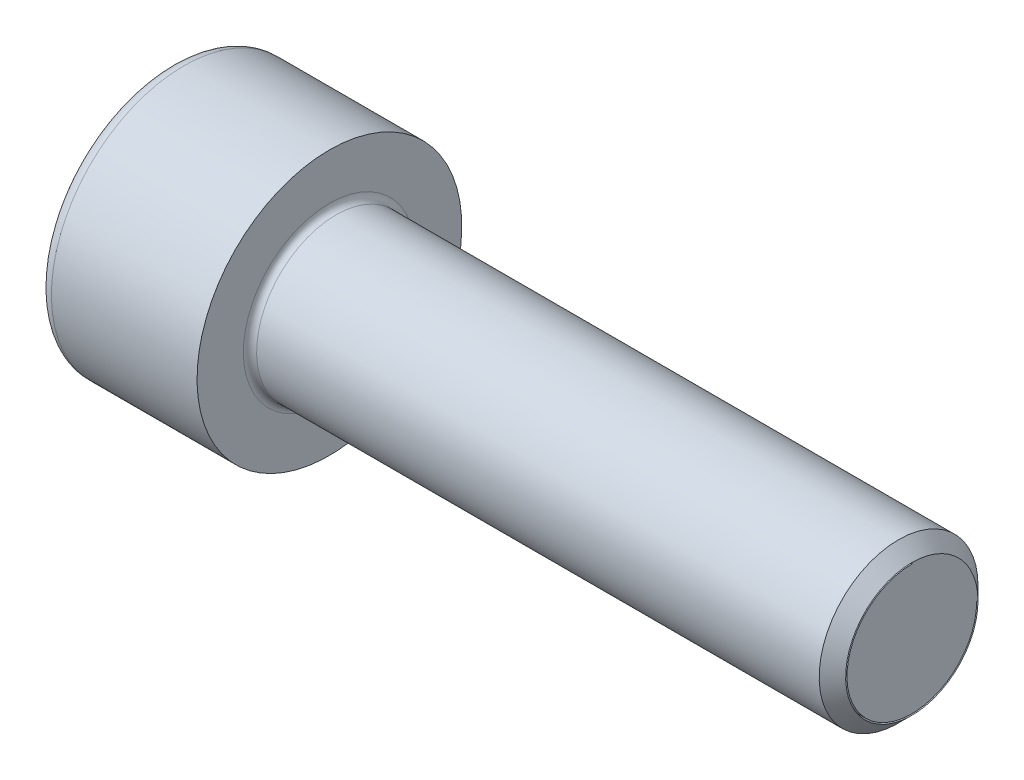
ISO-10303-21;
HEADER;
FILE_DESCRIPTION(('STEP AP214'),'2;1');
FILE_NAME('part.step','',(''),(''),'','','');
FILE_SCHEMA(('AUTOMOTIVE_DESIGN { 1 0 10303 214 1 1 1 1 }'));
ENDSEC;
DATA;
#1=APPLICATION_CONTEXT('core data for automotive mechanical design processes');
#2=APPLICATION_PROTOCOL_DEFINITION('international standard','automotive_design',2000,#1);
#3=PRODUCT_CONTEXT('',#1,'mechanical');
#4=PRODUCT('Part','Part','',(#3));
#5=PRODUCT_RELATED_PRODUCT_CATEGORY('part','',(#4));
#6=PRODUCT_DEFINITION_FORMATION('','',#4);
#7=PRODUCT_DEFINITION_CONTEXT('part definition',#1,'design');
#8=PRODUCT_DEFINITION('design','',#6,#7);
#9=PRODUCT_DEFINITION_SHAPE('','',#8);
#10=(LENGTH_UNIT() NAMED_UNIT(*) SI_UNIT(.MILLI.,.METRE.));
#11=(NAMED_UNIT(*) PLANE_ANGLE_UNIT() SI_UNIT($,.RADIAN.));
#12=(NAMED_UNIT(*) SI_UNIT($,.STERADIAN.) SOLID_ANGLE_UNIT());
#13=UNCERTAINTY_MEASURE_WITH_UNIT(LENGTH_MEASURE(1.E-05),#10,'distance_accuracy_value','');
#14=(GEOMETRIC_REPRESENTATION_CONTEXT(3) GLOBAL_UNCERTAINTY_ASSIGNED_CONTEXT((#13)) GLOBAL_UNIT_ASSIGNED_CONTEXT((#10,
#11,#12)) REPRESENTATION_CONTEXT('',''));
#15=CARTESIAN_POINT('',(0.,0.,0.));
#16=DIRECTION('',(0.,0.,1.));
#17=DIRECTION('',(1.,0.,0.));
#18=AXIS2_PLACEMENT_3D('',#15,#16,#17);
#19=CARTESIAN_POINT('',(-36.2000000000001,29.5000000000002,81.0000000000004));
#20=DIRECTION('',(1.,0.,0.));
#21=DIRECTION('',(0.,0.,-1.));
#22=AXIS2_PLACEMENT_3D('',#19,#20,#21);
#23=PLANE('',#22);
#24=CARTESIAN_POINT('',(-36.2000000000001,28.0000000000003,81.0000000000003));
#25=DIRECTION('',(-1.,0.,0.));
#26=DIRECTION('',(0.,1.,0.));
#27=AXIS2_PLACEMENT_3D('',#24,#25,#26);
#28=CIRCLE('',#27,2.45);
#29=CARTESIAN_POINT('',(-36.2000000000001,28.0000000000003,78.5500000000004));
#30=VERTEX_POINT('',#29);
#31=CARTESIAN_POINT('',(-36.2000000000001,30.4500000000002,81.0000000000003));
#32=VERTEX_POINT('',#31);
#33=EDGE_CURVE('E58',#30,#32,#28,.T.);
#34=ORIENTED_EDGE('',*,*,#33,.T.);
#35=DIRECTION('',(0.,1.,0.));
#36=VECTOR('',#35,1.);
#37=CARTESIAN_POINT('',(-36.2000000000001,29.9875000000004,81.0000000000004));
#38=LINE('',#37,#36);
#39=CARTESIAN_POINT('',(-36.2000000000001,30.5000000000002,81.0000000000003));
#40=VERTEX_POINT('',#39);
#41=EDGE_CURVE('E280',#32,#40,#38,.T.);
#42=ORIENTED_EDGE('',*,*,#41,.T.);
#43=CARTESIAN_POINT('',(-36.2000000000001,28.0000000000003,81.0000000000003));
#44=DIRECTION('',(1.,0.,0.));
#45=DIRECTION('',(0.,1.,0.));
#46=AXIS2_PLACEMENT_3D('',#43,#44,#45);
#47=CIRCLE('',#46,2.5);
#48=CARTESIAN_POINT('',(-36.2000000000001,28.0000000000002,78.5000000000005));
#49=VERTEX_POINT('',#48);
#50=EDGE_CURVE('E251',#40,#49,#47,.T.);
#51=ORIENTED_EDGE('',*,*,#50,.T.);
#52=DIRECTION('',(0.,0.,1.));
#53=VECTOR('',#52,1.);
#54=CARTESIAN_POINT('',(-36.2000000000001,28.0000000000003,79.7625000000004));
#55=LINE('',#54,#53);
#56=EDGE_CURVE('E281',#49,#30,#55,.T.);
#57=ORIENTED_EDGE('',*,*,#56,.T.);
#58=EDGE_LOOP('',(#34,#42,#51,#57));
#59=FACE_BOUND('',#58,.T.);
#60=ADVANCED_FACE('F40',(#59),#23,.T.);
#61=CARTESIAN_POINT('',(-37.5750000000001,28.0000000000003,81.0000000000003));
#62=DIRECTION('',(-1.,0.,0.));
#63=DIRECTION('',(0.,0.,1.));
#64=AXIS2_PLACEMENT_3D('',#61,#62,#63);
#65=CYLINDRICAL_SURFACE('',#64,3.);
#66=CARTESIAN_POINT('',(-17.7,28.0000000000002,81.0000000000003));
#67=DIRECTION('',(1.,0.,0.));
#68=DIRECTION('',(0.,0.,-1.));
#69=AXIS2_PLACEMENT_3D('',#66,#67,#68);
#70=CIRCLE('',#69,3.);
#71=CARTESIAN_POINT('',(-17.7,28.0000000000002,78.0000000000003));
#72=VERTEX_POINT('',#71);
#73=EDGE_CURVE('E11',#72,#72,#70,.F.);
#74=ORIENTED_EDGE('',*,*,#73,.T.);
#75=EDGE_LOOP('',(#74));
#76=FACE_BOUND('',#75,.T.);
#77=CARTESIAN_POINT('',(-38.9500000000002,28.0000000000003,81.0000000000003));
#78=DIRECTION('',(1.,0.,0.));
#79=DIRECTION('',(0.,1.,0.));
#80=AXIS2_PLACEMENT_3D('',#77,#78,#79);
#81=CIRCLE('',#80,3.);
#82=CARTESIAN_POINT('',(-38.9500000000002,31.0000000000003,81.0000000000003));
#83=VERTEX_POINT('',#82);
#84=EDGE_CURVE('E275',#83,#83,#81,.T.);
#85=ORIENTED_EDGE('',*,*,#84,.T.);
#86=EDGE_LOOP('',(#85));
#87=FACE_BOUND('',#86,.T.);
#88=ADVANCED_FACE('F162',(#76,#87),#65,.T.);
#89=CARTESIAN_POINT('',(-38.9500000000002,28.0000000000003,81.0000000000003));
#90=DIRECTION('',(1.,0.,0.));
#91=DIRECTION('',(0.,0.,-1.));
#92=AXIS2_PLACEMENT_3D('',#89,#90,#91);
#93=TOROIDAL_SURFACE('',#92,3.24999999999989,0.25);
#94=CARTESIAN_POINT('',(-39.2000000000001,28.0000000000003,81.0000000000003));
#95=DIRECTION('',(1.,0.,0.));
#96=DIRECTION('',(0.,1.,0.));
#97=AXIS2_PLACEMENT_3D('',#94,#95,#96);
#98=CIRCLE('',#97,3.25);
#99=CARTESIAN_POINT('',(-39.2000000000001,31.2500000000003,81.0000000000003));
#100=VERTEX_POINT('',#99);
#101=EDGE_CURVE('E271',#100,#100,#98,.T.);
#102=ORIENTED_EDGE('',*,*,#101,.T.);
#103=EDGE_LOOP('',(#102));
#104=FACE_BOUND('',#103,.T.);
#105=ORIENTED_EDGE('',*,*,#84,.F.);
#106=EDGE_LOOP('',(#105));
#107=FACE_BOUND('',#106,.T.);
#108=ADVANCED_FACE('F157',(#104,#107),#93,.F.);
#109=CARTESIAN_POINT('',(-39.2000000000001,32.1250000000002,81.0000000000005));
#110=DIRECTION('',(1.,0.,0.));
#111=DIRECTION('',(0.,0.,-1.));
#112=AXIS2_PLACEMENT_3D('',#109,#110,#111);
#113=PLANE('',#112);
#114=CARTESIAN_POINT('',(-39.2000000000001,28.0000000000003,81.0000000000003));
#115=DIRECTION('',(1.,0.,0.));
#116=DIRECTION('',(0.,1.,0.));
#117=AXIS2_PLACEMENT_3D('',#114,#115,#116);
#118=CIRCLE('',#117,5.);
#119=CARTESIAN_POINT('',(-39.2000000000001,33.0000000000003,81.0000000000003));
#120=VERTEX_POINT('',#119);
#121=EDGE_CURVE('E291',#120,#120,#118,.T.);
#122=ORIENTED_EDGE('',*,*,#121,.T.);
#123=EDGE_LOOP('',(#122));
#124=FACE_BOUND('',#123,.T.);
#125=ORIENTED_EDGE('',*,*,#101,.F.);
#126=EDGE_LOOP('',(#125));
#127=FACE_BOUND('',#126,.T.);
#128=ADVANCED_FACE('F161',(#124,#127),#113,.T.);
#129=CARTESIAN_POINT('',(-41.9500000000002,28.0000000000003,81.0000000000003));
#130=DIRECTION('',(-1.,0.,0.));
#131=DIRECTION('',(0.,0.,1.));
#132=AXIS2_PLACEMENT_3D('',#129,#130,#131);
#133=CYLINDRICAL_SURFACE('',#132,5.);
#134=CARTESIAN_POINT('',(-44.7000000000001,28.0000000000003,81.0000000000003));
#135=DIRECTION('',(1.,0.,0.));
#136=DIRECTION('',(0.,1.,0.));
#137=AXIS2_PLACEMENT_3D('',#134,#135,#136);
#138=CIRCLE('',#137,5.);
#139=CARTESIAN_POINT('',(-44.7000000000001,33.0000000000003,81.0000000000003));
#140=VERTEX_POINT('',#139);
#141=EDGE_CURVE('E255',#140,#140,#138,.T.);
#142=ORIENTED_EDGE('',*,*,#141,.T.);
#143=EDGE_LOOP('',(#142));
#144=FACE_BOUND('',#143,.T.);
#145=ORIENTED_EDGE('',*,*,#121,.F.);
#146=EDGE_LOOP('',(#145));
#147=FACE_BOUND('',#146,.T.);
#148=ADVANCED_FACE('F167',(#144,#147),#133,.T.);
#149=CARTESIAN_POINT('',(-44.7000000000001,28.0000000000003,81.0000000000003));
#150=DIRECTION('',(1.,0.,0.));
#151=DIRECTION('',(0.,0.,-1.));
#152=AXIS2_PLACEMENT_3D('',#149,#150,#151);
#153=TOROIDAL_SURFACE('',#152,4.49999999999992,0.5);
#154=CARTESIAN_POINT('',(-45.2000000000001,28.0000000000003,81.0000000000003));
#155=DIRECTION('',(1.,0.,0.));
#156=DIRECTION('',(0.,1.,0.));
#157=AXIS2_PLACEMENT_3D('',#154,#155,#156);
#158=CIRCLE('',#157,4.5);
#159=CARTESIAN_POINT('',(-45.2000000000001,32.5000000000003,81.0000000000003));
#160=VERTEX_POINT('',#159);
#161=EDGE_CURVE('E147',#160,#160,#158,.T.);
#162=ORIENTED_EDGE('',*,*,#161,.T.);
#163=EDGE_LOOP('',(#162));
#164=FACE_BOUND('',#163,.T.);
#165=ORIENTED_EDGE('',*,*,#141,.F.);
#166=EDGE_LOOP('',(#165));
#167=FACE_BOUND('',#166,.T.);
#168=ADVANCED_FACE('F171',(#164,#167),#153,.T.);
#169=CARTESIAN_POINT('',(-45.2000000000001,30.2500000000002,81.0000000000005));
#170=DIRECTION('',(-1.,0.,0.));
#171=DIRECTION('',(0.,0.,1.));
#172=AXIS2_PLACEMENT_3D('',#169,#170,#171);
#173=PLANE('',#172);
#174=ORIENTED_EDGE('',*,*,#161,.F.);
#175=EDGE_LOOP('',(#174));
#176=FACE_BOUND('',#175,.T.);
#177=DIRECTION('',(0.,-0.500000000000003,-0.866025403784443));
#178=VECTOR('',#177,1.);
#179=CARTESIAN_POINT('',(-45.2,26.4770304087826,83.3621392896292));
#180=LINE('',#179,#178);
#181=CARTESIAN_POINT('',(-45.2,26.5566243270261,83.5000000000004));
#182=VERTEX_POINT('',#181);
#183=CARTESIAN_POINT('',(-45.2,25.1132486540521,81.0000000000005));
#184=VERTEX_POINT('',#183);
#185=EDGE_CURVE('E141',#182,#184,#180,.T.);
#186=ORIENTED_EDGE('',*,*,#185,.T.);
#187=DIRECTION('',(0.,0.5,-0.866025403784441));
#188=VECTOR('',#187,1.);
#189=CARTESIAN_POINT('',(-45.2,25.7553425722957,79.8878607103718));
#190=LINE('',#189,#188);
#191=CARTESIAN_POINT('',(-45.2,26.5566243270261,78.5000000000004));
#192=VERTEX_POINT('',#191);
#193=EDGE_CURVE('E123',#184,#192,#190,.T.);
#194=ORIENTED_EDGE('',*,*,#193,.T.);
#195=DIRECTION('',(0.,1.,0.));
#196=VECTOR('',#195,1.);
#197=CARTESIAN_POINT('',(-45.2000000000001,28.4033121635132,78.5000000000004));
#198=LINE('',#197,#196);
#199=CARTESIAN_POINT('',(-45.2000000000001,29.4433756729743,78.5000000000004));
#200=VERTEX_POINT('',#199);
#201=EDGE_CURVE('E133',#192,#200,#198,.T.);
#202=ORIENTED_EDGE('',*,*,#201,.T.);
#203=DIRECTION('',(0.,0.500000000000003,0.866025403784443));
#204=VECTOR('',#203,1.);
#205=CARTESIAN_POINT('',(-45.2000000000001,30.0854695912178,79.612139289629));
#206=LINE('',#205,#204);
#207=CARTESIAN_POINT('',(-45.2000000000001,30.8867513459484,81.0000000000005));
#208=VERTEX_POINT('',#207);
#209=EDGE_CURVE('E112',#200,#208,#206,.T.);
#210=ORIENTED_EDGE('',*,*,#209,.T.);
#211=DIRECTION('',(0.,-0.5,0.866025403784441));
#212=VECTOR('',#211,1.);
#213=CARTESIAN_POINT('',(-45.2000000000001,30.8071574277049,81.1378607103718));
#214=LINE('',#213,#212);
#215=CARTESIAN_POINT('',(-45.2000000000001,29.4433756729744,83.5000000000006));
#216=VERTEX_POINT('',#215);
#217=EDGE_CURVE('E287',#208,#216,#214,.T.);
#218=ORIENTED_EDGE('',*,*,#217,.T.);
#219=DIRECTION('',(0.,-1.,0.));
#220=VECTOR('',#219,1.);
#221=CARTESIAN_POINT('',(-45.2000000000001,29.8466878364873,83.5000000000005));
#222=LINE('',#221,#220);
#223=EDGE_CURVE('E284',#216,#182,#222,.T.);
#224=ORIENTED_EDGE('',*,*,#223,.T.);
#225=EDGE_LOOP('',(#186,#194,#202,#210,#218,#224));
#226=FACE_BOUND('',#225,.T.);
#227=ADVANCED_FACE('F139',(#176,#226),#173,.T.);
#228=CARTESIAN_POINT('',(-42.2000000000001,28.0000000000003,81.0000000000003));
#229=DIRECTION('',(-1.,0.,0.));
#230=DIRECTION('',(0.,-1.,0.));
#231=AXIS2_PLACEMENT_3D('',#228,#229,#230);
#232=PLANE('',#231);
#233=DIRECTION('',(0.,1.,0.));
#234=VECTOR('',#233,1.);
#235=CARTESIAN_POINT('',(-42.2,26.5566243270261,83.5000000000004));
#236=LINE('',#235,#234);
#237=CARTESIAN_POINT('',(-42.2,26.5566243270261,83.5000000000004));
#238=VERTEX_POINT('',#237);
#239=CARTESIAN_POINT('',(-42.2000000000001,29.4433756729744,83.5000000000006));
#240=VERTEX_POINT('',#239);
#241=EDGE_CURVE('E288',#238,#240,#236,.T.);
#242=ORIENTED_EDGE('',*,*,#241,.T.);
#243=DIRECTION('',(0.,0.5,-0.866025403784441));
#244=VECTOR('',#243,1.);
#245=CARTESIAN_POINT('',(-42.2000000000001,29.4433756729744,83.5000000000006));
#246=LINE('',#245,#244);
#247=CARTESIAN_POINT('',(-42.2000000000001,30.8867513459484,81.0000000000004));
#248=VERTEX_POINT('',#247);
#249=EDGE_CURVE('E317',#240,#248,#246,.T.);
#250=ORIENTED_EDGE('',*,*,#249,.T.);
#251=DIRECTION('',(0.,-0.500000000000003,-0.866025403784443));
#252=VECTOR('',#251,1.);
#253=CARTESIAN_POINT('',(-42.2000000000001,30.8867513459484,81.0000000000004));
#254=LINE('',#253,#252);
#255=CARTESIAN_POINT('',(-42.2000000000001,29.4433756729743,78.5000000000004));
#256=VERTEX_POINT('',#255);
#257=EDGE_CURVE('E297',#248,#256,#254,.T.);
#258=ORIENTED_EDGE('',*,*,#257,.T.);
#259=DIRECTION('',(0.,-1.,0.));
#260=VECTOR('',#259,1.);
#261=CARTESIAN_POINT('',(-42.2000000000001,29.4433756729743,78.5000000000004));
#262=LINE('',#261,#260);
#263=CARTESIAN_POINT('',(-42.2,26.5566243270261,78.5000000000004));
#264=VERTEX_POINT('',#263);
#265=EDGE_CURVE('E295',#256,#264,#262,.T.);
#266=ORIENTED_EDGE('',*,*,#265,.T.);
#267=DIRECTION('',(0.,-0.5,0.866025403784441));
#268=VECTOR('',#267,1.);
#269=CARTESIAN_POINT('',(-42.2,26.5566243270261,78.5000000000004));
#270=LINE('',#269,#268);
#271=CARTESIAN_POINT('',(-42.2,25.1132486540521,81.0000000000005));
#272=VERTEX_POINT('',#271);
#273=EDGE_CURVE('E125',#264,#272,#270,.T.);
#274=ORIENTED_EDGE('',*,*,#273,.T.);
#275=DIRECTION('',(0.,0.500000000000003,0.866025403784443));
#276=VECTOR('',#275,1.);
#277=CARTESIAN_POINT('',(-42.2,25.1132486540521,81.0000000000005));
#278=LINE('',#277,#276);
#279=EDGE_CURVE('E302',#272,#238,#278,.T.);
#280=ORIENTED_EDGE('',*,*,#279,.T.);
#281=EDGE_LOOP('',(#242,#250,#258,#266,#274,#280));
#282=FACE_BOUND('',#281,.T.);
#283=ADVANCED_FACE('F178',(#282),#232,.T.);
#284=CARTESIAN_POINT('',(-42.2,26.5566243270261,78.5000000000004));
#285=DIRECTION('',(0.,0.,1.));
#286=DIRECTION('',(1.,0.,0.));
#287=AXIS2_PLACEMENT_3D('',#284,#285,#286);
#288=PLANE('',#287);
#289=ORIENTED_EDGE('',*,*,#201,.F.);
#290=DIRECTION('',(-1.,0.,0.));
#291=VECTOR('',#290,1.);
#292=CARTESIAN_POINT('',(-42.2,26.5566243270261,78.5000000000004));
#293=LINE('',#292,#291);
#294=EDGE_CURVE('E119',#264,#192,#293,.T.);
#295=ORIENTED_EDGE('',*,*,#294,.F.);
#296=ORIENTED_EDGE('',*,*,#265,.F.);
#297=DIRECTION('',(-1.,0.,0.));
#298=VECTOR('',#297,1.);
#299=CARTESIAN_POINT('',(-42.2000000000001,29.4433756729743,78.5000000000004));
#300=LINE('',#299,#298);
#301=EDGE_CURVE('E129',#256,#200,#300,.T.);
#302=ORIENTED_EDGE('',*,*,#301,.T.);
#303=EDGE_LOOP('',(#289,#295,#296,#302));
#304=FACE_BOUND('',#303,.T.);
#305=ADVANCED_FACE('F134',(#304),#288,.T.);
#306=CARTESIAN_POINT('',(-42.2,25.1132486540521,81.0000000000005));
#307=DIRECTION('',(0.,0.866025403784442,0.500000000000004));
#308=DIRECTION('',(0.,-0.5,0.866025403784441));
#309=AXIS2_PLACEMENT_3D('',#306,#307,#308);
#310=PLANE('',#309);
#311=ORIENTED_EDGE('',*,*,#193,.F.);
#312=DIRECTION('',(-1.,0.,0.));
#313=VECTOR('',#312,1.);
#314=CARTESIAN_POINT('',(-42.2,25.1132486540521,81.0000000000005));
#315=LINE('',#314,#313);
#316=EDGE_CURVE('E130',#272,#184,#315,.T.);
#317=ORIENTED_EDGE('',*,*,#316,.F.);
#318=ORIENTED_EDGE('',*,*,#273,.F.);
#319=ORIENTED_EDGE('',*,*,#294,.T.);
#320=EDGE_LOOP('',(#311,#317,#318,#319));
#321=FACE_BOUND('',#320,.T.);
#322=ADVANCED_FACE('F121',(#321),#310,.T.);
#323=CARTESIAN_POINT('',(-42.2,26.5566243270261,83.5000000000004));
#324=DIRECTION('',(0.,0.86602540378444,-0.5));
#325=DIRECTION('',(0.,0.500000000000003,0.866025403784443));
#326=AXIS2_PLACEMENT_3D('',#323,#324,#325);
#327=PLANE('',#326);
#328=ORIENTED_EDGE('',*,*,#185,.F.);
#329=DIRECTION('',(-1.,0.,0.));
#330=VECTOR('',#329,1.);
#331=CARTESIAN_POINT('',(-42.2,26.5566243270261,83.5000000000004));
#332=LINE('',#331,#330);
#333=EDGE_CURVE('E313',#238,#182,#332,.T.);
#334=ORIENTED_EDGE('',*,*,#333,.F.);
#335=ORIENTED_EDGE('',*,*,#279,.F.);
#336=ORIENTED_EDGE('',*,*,#316,.T.);
#337=EDGE_LOOP('',(#328,#334,#335,#336));
#338=FACE_BOUND('',#337,.T.);
#339=ADVANCED_FACE('F187',(#338),#327,.T.);
#340=CARTESIAN_POINT('',(-42.2000000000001,29.4433756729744,83.5000000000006));
#341=DIRECTION('',(0.,0.,-1.));
#342=DIRECTION('',(-1.,0.,0.));
#343=AXIS2_PLACEMENT_3D('',#340,#341,#342);
#344=PLANE('',#343);
#345=ORIENTED_EDGE('',*,*,#223,.F.);
#346=DIRECTION('',(-1.,0.,0.));
#347=VECTOR('',#346,1.);
#348=CARTESIAN_POINT('',(-42.2000000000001,29.4433756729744,83.5000000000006));
#349=LINE('',#348,#347);
#350=EDGE_CURVE('E326',#240,#216,#349,.T.);
#351=ORIENTED_EDGE('',*,*,#350,.F.);
#352=ORIENTED_EDGE('',*,*,#241,.F.);
#353=ORIENTED_EDGE('',*,*,#333,.T.);
#354=EDGE_LOOP('',(#345,#351,#352,#353));
#355=FACE_BOUND('',#354,.T.);
#356=ADVANCED_FACE('F190',(#355),#344,.T.);
#357=CARTESIAN_POINT('',(-42.2000000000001,30.8867513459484,81.0000000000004));
#358=DIRECTION('',(0.,-0.866025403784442,-0.500000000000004));
#359=DIRECTION('',(0.,0.5,-0.866025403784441));
#360=AXIS2_PLACEMENT_3D('',#357,#358,#359);
#361=PLANE('',#360);
#362=ORIENTED_EDGE('',*,*,#217,.F.);
#363=DIRECTION('',(-1.,0.,0.));
#364=VECTOR('',#363,1.);
#365=CARTESIAN_POINT('',(-42.2000000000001,30.8867513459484,81.0000000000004));
#366=LINE('',#365,#364);
#367=EDGE_CURVE('E151',#248,#208,#366,.T.);
#368=ORIENTED_EDGE('',*,*,#367,.F.);
#369=ORIENTED_EDGE('',*,*,#249,.F.);
#370=ORIENTED_EDGE('',*,*,#350,.T.);
#371=EDGE_LOOP('',(#362,#368,#369,#370));
#372=FACE_BOUND('',#371,.T.);
#373=ADVANCED_FACE('F194',(#372),#361,.T.);
#374=CARTESIAN_POINT('',(-42.2000000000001,29.4433756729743,78.5000000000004));
#375=DIRECTION('',(0.,-0.86602540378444,0.5));
#376=DIRECTION('',(0.,-0.500000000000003,-0.866025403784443));
#377=AXIS2_PLACEMENT_3D('',#374,#375,#376);
#378=PLANE('',#377);
#379=ORIENTED_EDGE('',*,*,#209,.F.);
#380=ORIENTED_EDGE('',*,*,#301,.F.);
#381=ORIENTED_EDGE('',*,*,#257,.F.);
#382=ORIENTED_EDGE('',*,*,#367,.T.);
#383=EDGE_LOOP('',(#379,#380,#381,#382));
#384=FACE_BOUND('',#383,.T.);
#385=ADVANCED_FACE('F198',(#384),#378,.T.);
#386=CARTESIAN_POINT('',(-17.2,28.0000000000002,81.0000000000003));
#387=DIRECTION('',(1.,0.,0.));
#388=DIRECTION('',(0.,0.,-1.));
#389=AXIS2_PLACEMENT_3D('',#386,#387,#388);
#390=PLANE('',#389);
#391=DIRECTION('',(0.,0.,-1.));
#392=VECTOR('',#391,1.);
#393=CARTESIAN_POINT('',(-17.2,28.0000000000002,79.7625000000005));
#394=LINE('',#393,#392);
#395=CARTESIAN_POINT('',(-17.2,28.0000000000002,78.5500000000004));
#396=VERTEX_POINT('',#395);
#397=CARTESIAN_POINT('',(-17.2,28.0000000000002,78.5000000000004));
#398=VERTEX_POINT('',#397);
#399=EDGE_CURVE('E239',#396,#398,#394,.T.);
#400=ORIENTED_EDGE('',*,*,#399,.T.);
#401=CARTESIAN_POINT('',(-17.2,28.0000000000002,81.0000000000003));
#402=DIRECTION('',(1.,0.,0.));
#403=DIRECTION('',(0.,0.,-1.));
#404=AXIS2_PLACEMENT_3D('',#401,#402,#403);
#405=CIRCLE('',#404,2.49999999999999);
#406=CARTESIAN_POINT('',(-17.2,30.5000000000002,81.0000000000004));
#407=VERTEX_POINT('',#406);
#408=EDGE_CURVE('E50',#398,#407,#405,.T.);
#409=ORIENTED_EDGE('',*,*,#408,.T.);
#410=DIRECTION('',(0.,-1.,0.));
#411=VECTOR('',#410,1.);
#412=CARTESIAN_POINT('',(-17.2,29.2375000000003,81.0000000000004));
#413=LINE('',#412,#411);
#414=CARTESIAN_POINT('',(-17.2,30.4500000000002,81.0000000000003));
#415=VERTEX_POINT('',#414);
#416=EDGE_CURVE('E240',#407,#415,#413,.T.);
#417=ORIENTED_EDGE('',*,*,#416,.T.);
#418=CARTESIAN_POINT('',(-17.2,28.0000000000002,81.0000000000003));
#419=DIRECTION('',(1.,0.,0.));
#420=DIRECTION('',(0.,1.,0.));
#421=AXIS2_PLACEMENT_3D('',#418,#419,#420);
#422=CIRCLE('',#421,2.45);
#423=EDGE_CURVE('E278',#415,#396,#422,.T.);
#424=ORIENTED_EDGE('',*,*,#423,.T.);
#425=EDGE_LOOP('',(#400,#409,#417,#424));
#426=FACE_BOUND('',#425,.T.);
#427=ADVANCED_FACE('F202',(#426),#390,.T.);
#428=CARTESIAN_POINT('',(-26.7000000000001,28.0000000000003,78.5250000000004));
#429=DIRECTION('',(0.,-1.,0.));
#430=DIRECTION('',(0.,0.,-1.));
#431=AXIS2_PLACEMENT_3D('',#428,#429,#430);
#432=PLANE('',#431);
#433=DIRECTION('',(1.,0.,0.));
#434=VECTOR('',#433,1.);
#435=CARTESIAN_POINT('',(-17.2,28.0000000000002,78.5000000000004));
#436=LINE('',#435,#434);
#437=EDGE_CURVE('E258',#49,#398,#436,.T.);
#438=ORIENTED_EDGE('',*,*,#437,.T.);
#439=ORIENTED_EDGE('',*,*,#399,.F.);
#440=DIRECTION('',(-1.,0.,0.));
#441=VECTOR('',#440,1.);
#442=CARTESIAN_POINT('',(-36.2000000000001,28.0000000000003,78.5500000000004));
#443=LINE('',#442,#441);
#444=EDGE_CURVE('E261',#396,#30,#443,.T.);
#445=ORIENTED_EDGE('',*,*,#444,.T.);
#446=ORIENTED_EDGE('',*,*,#56,.F.);
#447=EDGE_LOOP('',(#438,#439,#445,#446));
#448=FACE_BOUND('',#447,.T.);
#449=ADVANCED_FACE('F205',(#448),#432,.T.);
#450=CARTESIAN_POINT('',(-26.7000000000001,30.4750000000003,81.0000000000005));
#451=DIRECTION('',(0.,0.,1.));
#452=DIRECTION('',(1.,0.,0.));
#453=AXIS2_PLACEMENT_3D('',#450,#451,#452);
#454=PLANE('',#453);
#455=ORIENTED_EDGE('',*,*,#41,.F.);
#456=DIRECTION('',(1.,0.,0.));
#457=VECTOR('',#456,1.);
#458=CARTESIAN_POINT('',(-36.2000000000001,30.4500000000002,81.0000000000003));
#459=LINE('',#458,#457);
#460=EDGE_CURVE('E254',#32,#415,#459,.T.);
#461=ORIENTED_EDGE('',*,*,#460,.T.);
#462=ORIENTED_EDGE('',*,*,#416,.F.);
#463=DIRECTION('',(-1.,0.,0.));
#464=VECTOR('',#463,1.);
#465=CARTESIAN_POINT('',(-17.2,30.5000000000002,81.0000000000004));
#466=LINE('',#465,#464);
#467=EDGE_CURVE('E249',#407,#40,#466,.T.);
#468=ORIENTED_EDGE('',*,*,#467,.T.);
#469=EDGE_LOOP('',(#455,#461,#462,#468));
#470=FACE_BOUND('',#469,.T.);
#471=ADVANCED_FACE('F209',(#470),#454,.T.);
#472=CARTESIAN_POINT('',(-26.7000000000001,28.0000000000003,81.0000000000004));
#473=DIRECTION('',(-1.,0.,0.));
#474=DIRECTION('',(0.,0.,1.));
#475=AXIS2_PLACEMENT_3D('',#472,#473,#474);
#476=CYLINDRICAL_SURFACE('',#475,2.45);
#477=ORIENTED_EDGE('',*,*,#460,.F.);
#478=ORIENTED_EDGE('',*,*,#33,.F.);
#479=ORIENTED_EDGE('',*,*,#444,.F.);
#480=ORIENTED_EDGE('',*,*,#423,.F.);
#481=EDGE_LOOP('',(#477,#478,#479,#480));
#482=FACE_BOUND('',#481,.T.);
#483=ADVANCED_FACE('F212',(#482),#476,.T.);
#484=CARTESIAN_POINT('',(-26.7000000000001,28.0000000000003,81.0000000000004));
#485=DIRECTION('',(-1.,0.,0.));
#486=DIRECTION('',(0.,0.,1.));
#487=AXIS2_PLACEMENT_3D('',#484,#485,#486);
#488=CYLINDRICAL_SURFACE('',#487,2.5);
#489=ORIENTED_EDGE('',*,*,#50,.F.);
#490=ORIENTED_EDGE('',*,*,#467,.F.);
#491=CARTESIAN_POINT('',(-17.2,28.0000000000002,81.0000000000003));
#492=DIRECTION('',(-1.,0.,0.));
#493=DIRECTION('',(0.,1.,0.));
#494=AXIS2_PLACEMENT_3D('',#491,#492,#493);
#495=CIRCLE('',#494,2.5);
#496=EDGE_CURVE('E235',#398,#407,#495,.T.);
#497=ORIENTED_EDGE('',*,*,#496,.F.);
#498=ORIENTED_EDGE('',*,*,#437,.F.);
#499=EDGE_LOOP('',(#489,#490,#497,#498));
#500=FACE_BOUND('',#499,.T.);
#501=ADVANCED_FACE('F42',(#500),#488,.F.);
#502=CARTESIAN_POINT('',(-17.2,28.0000000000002,81.0000000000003));
#503=DIRECTION('',(-1.,0.,0.));
#504=DIRECTION('',(0.,0.,1.));
#505=AXIS2_PLACEMENT_3D('',#502,#503,#504);
#506=CONICAL_SURFACE('',#505,2.49999999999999,0.785398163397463);
#507=ORIENTED_EDGE('',*,*,#73,.F.);
#508=EDGE_LOOP('',(#507));
#509=FACE_BOUND('',#508,.T.);
#510=ORIENTED_EDGE('',*,*,#496,.T.);
#511=ORIENTED_EDGE('',*,*,#408,.F.);
#512=EDGE_LOOP('',(#510,#511));
#513=FACE_BOUND('',#512,.T.);
#514=ADVANCED_FACE('F219',(#509,#513),#506,.T.);
#515=CLOSED_SHELL('',(#60,#88,#108,#128,#148,#168,#227,#283,#305,#322,#339,#356,#373,#385,#427,
#449,#471,#483,#501,#514));
#516=MANIFOLD_SOLID_BREP('B2',#515);
#517=ADVANCED_BREP_SHAPE_REPRESENTATION('',(#18,#516),#14);
#518=SHAPE_DEFINITION_REPRESENTATION(#9,#517);
ENDSEC;
END-ISO-10303-21;
